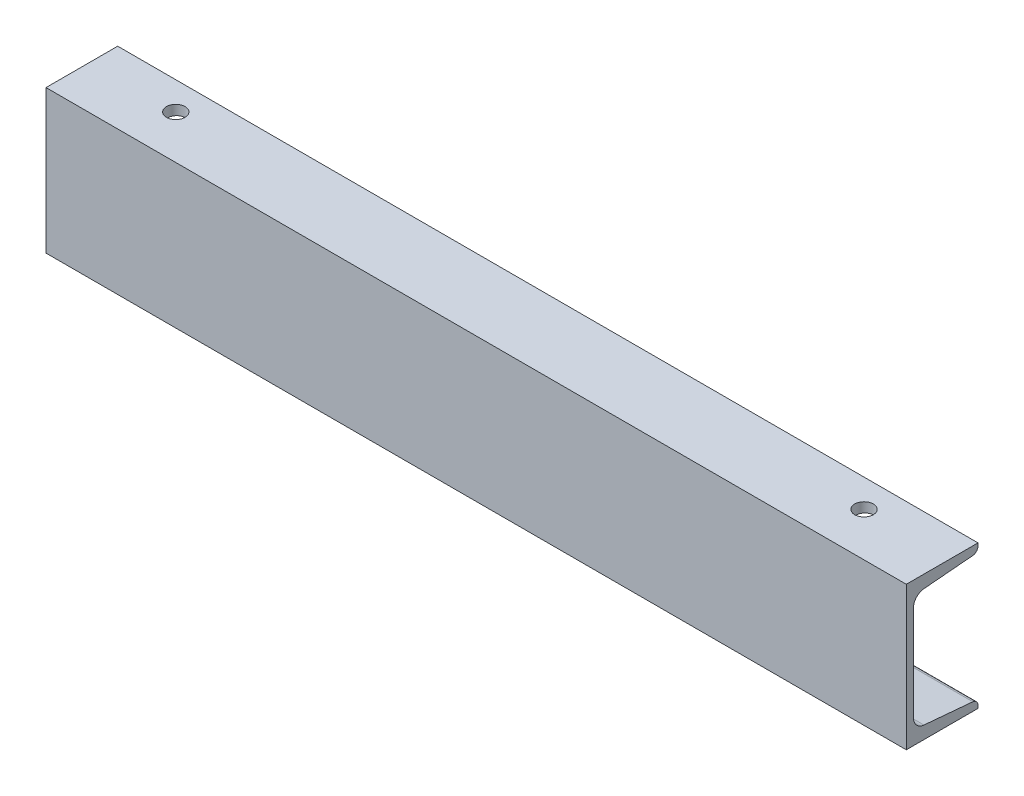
from build123d import *

# Parameters (mm, degrees)
EXTRUDE_1_DEPTH     = 600
SKETCH_5_R          = 6.5
CUT_EXTRUDE_1_DEPTH = 10


with BuildPart() as part:
    # Sketch 1 → Extrude 1 (new body)
    with BuildSketch(Plane(origin=(0, 0, 0), x_dir=(0, 0, -1), z_dir=(1, 0, 0))):
        with BuildLine():
            Line((0, 0), (0, 100))
            Line((0, 100), (50, 100))
            Line((50, 100), (50, 98.133819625))
            ThreePointArc((50, 98.133819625), (48.949109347, 95.431458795), (46.348622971, 94.149040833))
            Line((46.348622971, 94.149040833), (12.302754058, 91.170413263))
            ThreePointArc((12.302754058, 91.170413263), (7.101781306, 88.605577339), (5, 83.200855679))
            Line((5, 83.200855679), (5, 16.799144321))
            ThreePointArc((5, 16.799144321), (7.101781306, 11.394422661), (12.302754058, 8.829586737))
            Line((12.302754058, 8.829586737), (46.348622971, 5.850959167))
            ThreePointArc((46.348622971, 5.850959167), (48.949109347, 4.568541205), (50, 1.866180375))
            Line((50, 1.866180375), (50, 0))
            Line((50, 0), (0, 0))
        make_face()
    extrude(amount=EXTRUDE_1_DEPTH)

    # Sketch 5 → Cut-Extrude 1 (cut)
    with BuildSketch(Plane(origin=(0, 100, 0), x_dir=(-1, 0, 0), z_dir=(0, 1, 0))):
        with Locations(Location((-540, -30.5, 0), (0, 0, 90))):
            Circle(SKETCH_5_R)
        with Locations(Location((-60, -30.5, 0), (0, 0, 270))):
            Circle(SKETCH_5_R)
    extrude(amount=-CUT_EXTRUDE_1_DEPTH, mode=Mode.SUBTRACT)


solid = part.part
